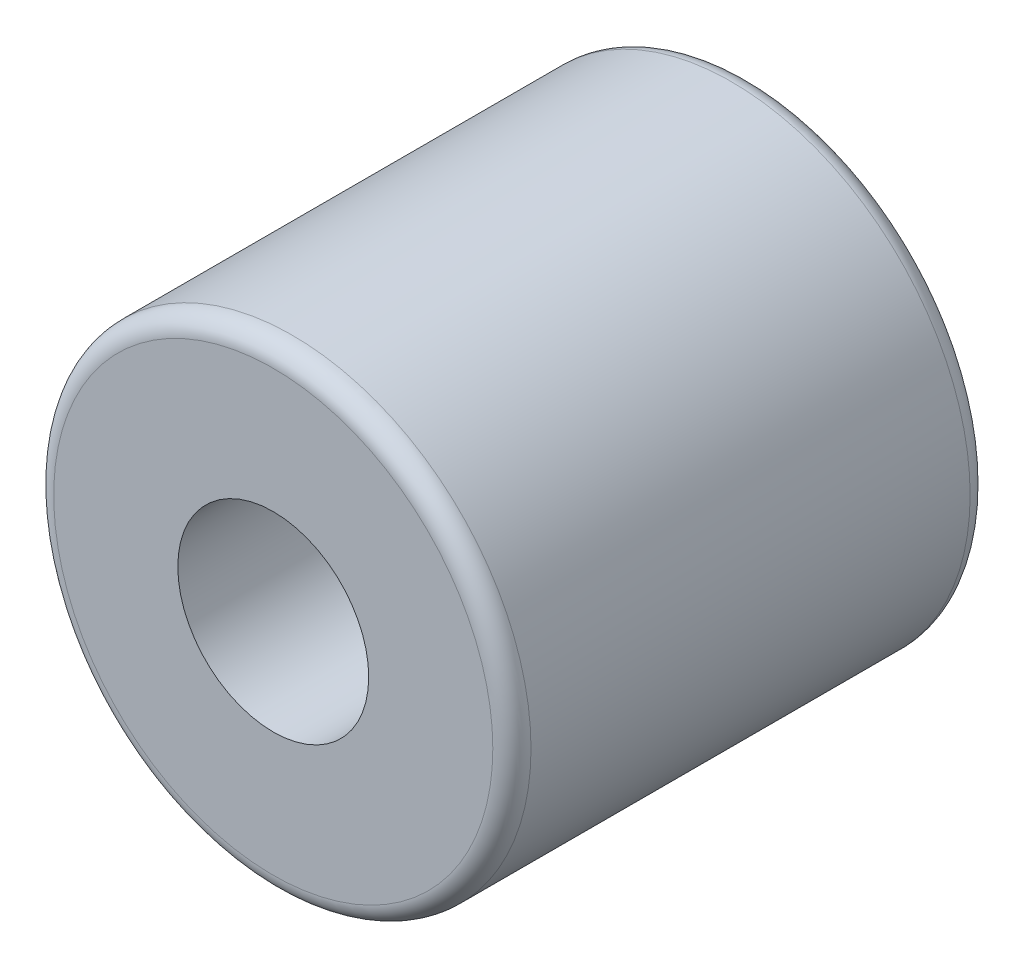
from build123d import *

# Parameters (mm, degrees)
SKETCH1_R           = 31.75
SKETCH1_R_2         = 12.7
BOSS_EXTRUDE1_DEPTH = 63.5
FILLET1_R           = 2.54


with BuildPart() as part:
    # Sketch1 → Boss-Extrude1 (new body)
    with BuildSketch(Plane.XY):
        Circle(SKETCH1_R)
        Circle(SKETCH1_R_2, mode=Mode.SUBTRACT)
    extrude(amount=BOSS_EXTRUDE1_DEPTH)

    # Fillet1
    fillet1_edges = [part.edges().sort_by_distance(p)[0] for p in [
        (-31.75, 0, 0),
        (-31.75, 0, 63.5),
    ]]
    fillet(fillet1_edges, radius=FILLET1_R)


solid = part.part
